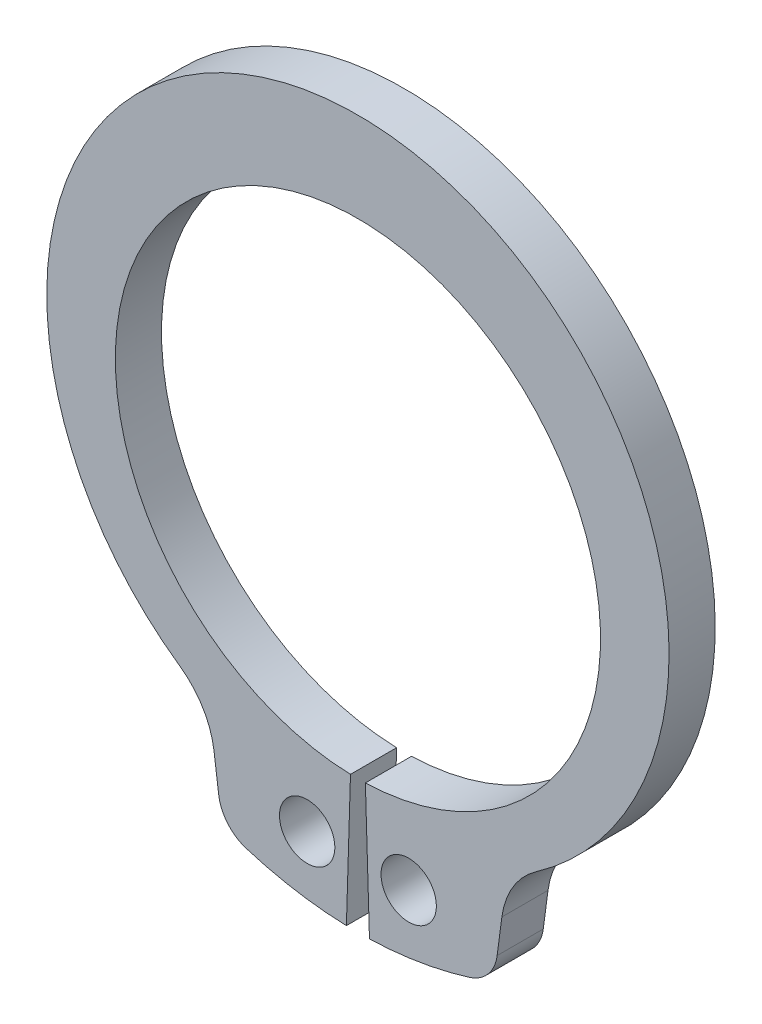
from build123d import *

# Parameters (mm, degrees)
BODYSKE_R  = 0.5334
BODY_DEPTH = 0.889


with BuildPart() as part:
    # BodySke → Body (new body)
    with BuildSketch(Plane.XY):
        with BuildLine():
            Line((0.143487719, -4.671396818), (0.22225, -7.235587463))
            ThreePointArc((0.22225, -7.235587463), (1.198799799, -7.139047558), (2.153320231, -6.911319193))
            ThreePointArc((2.153320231, -6.911319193), (2.509547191, -6.674607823), (2.682135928, -6.283272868))
            Line((2.682135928, -6.283272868), (2.772964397, -5.593362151))
            ThreePointArc((2.772964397, -5.593362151), (2.988346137, -4.981509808), (3.432204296, -4.508495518))
            ThreePointArc((3.432204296, -4.508495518), (0, 6.4008), (-3.432204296, -4.508495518))
            ThreePointArc((-3.432204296, -4.508495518), (-2.988346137, -4.981509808), (-2.772964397, -5.593362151))
            Line((-2.772964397, -5.593362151), (-2.682135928, -6.283272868))
            ThreePointArc((-2.682135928, -6.283272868), (-2.509547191, -6.674607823), (-2.153320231, -6.911319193))
            ThreePointArc((-2.153320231, -6.911319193), (-1.198799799, -7.139047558), (-0.22225, -7.235587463))
            Line((-0.22225, -7.235587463), (-0.143487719, -4.671396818))
            ThreePointArc((-0.143487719, -4.671396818), (0, 4.6736), (0.143487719, -4.671396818))
        make_face()
        with Locations((0.9779, -6.042784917)):
            Circle(BODYSKE_R, mode=Mode.SUBTRACT)
        with Locations((-0.9779, -6.042784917)):
            Circle(BODYSKE_R, mode=Mode.SUBTRACT)
    extrude(amount=-BODY_DEPTH)


solid = part.part
